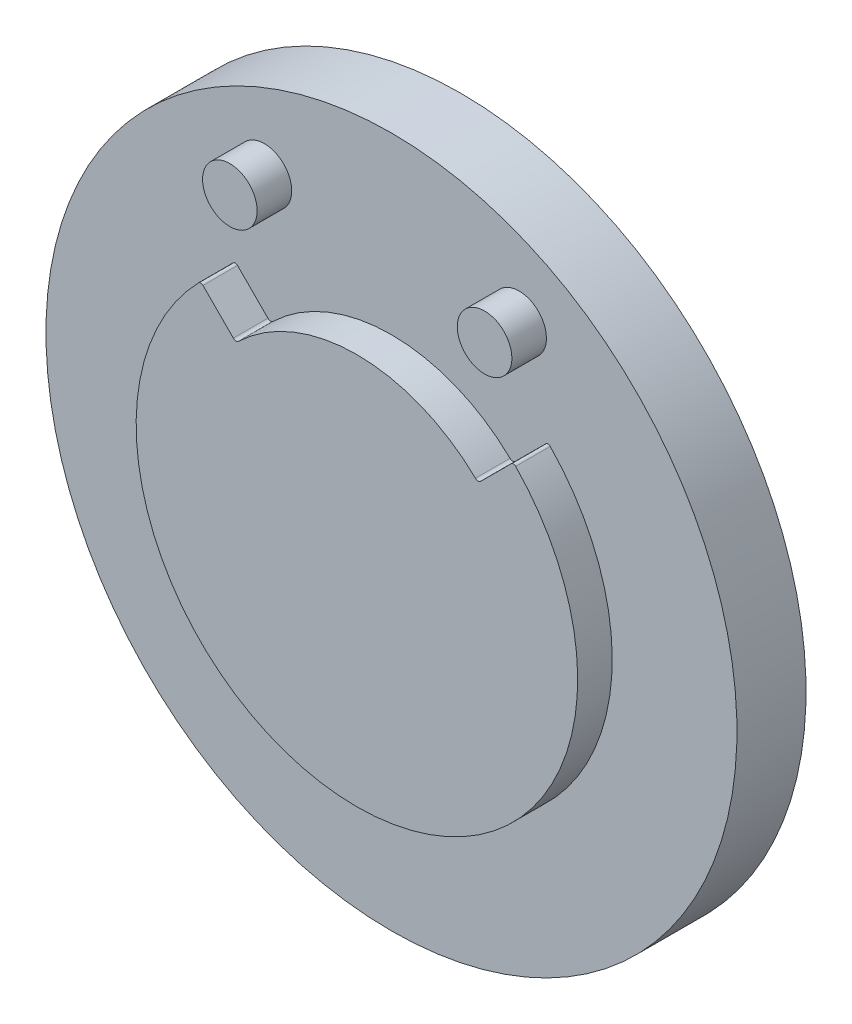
ISO-10303-21;
HEADER;
FILE_DESCRIPTION(('STEP AP214'),'2;1');
FILE_NAME('part.step','',(''),(''),'','','');
FILE_SCHEMA(('AUTOMOTIVE_DESIGN { 1 0 10303 214 1 1 1 1 }'));
ENDSEC;
DATA;
#1=APPLICATION_CONTEXT('core data for automotive mechanical design processes');
#2=APPLICATION_PROTOCOL_DEFINITION('international standard','automotive_design',2000,#1);
#3=PRODUCT_CONTEXT('',#1,'mechanical');
#4=PRODUCT('Part','Part','',(#3));
#5=PRODUCT_RELATED_PRODUCT_CATEGORY('part','',(#4));
#6=PRODUCT_DEFINITION_FORMATION('','',#4);
#7=PRODUCT_DEFINITION_CONTEXT('part definition',#1,'design');
#8=PRODUCT_DEFINITION('design','',#6,#7);
#9=PRODUCT_DEFINITION_SHAPE('','',#8);
#10=(LENGTH_UNIT() NAMED_UNIT(*) SI_UNIT(.MILLI.,.METRE.));
#11=(NAMED_UNIT(*) PLANE_ANGLE_UNIT() SI_UNIT($,.RADIAN.));
#12=(NAMED_UNIT(*) SI_UNIT($,.STERADIAN.) SOLID_ANGLE_UNIT());
#13=UNCERTAINTY_MEASURE_WITH_UNIT(LENGTH_MEASURE(1.E-05),#10,'distance_accuracy_value','');
#14=(GEOMETRIC_REPRESENTATION_CONTEXT(3) GLOBAL_UNCERTAINTY_ASSIGNED_CONTEXT((#13)) GLOBAL_UNIT_ASSIGNED_CONTEXT((#10,
#11,#12)) REPRESENTATION_CONTEXT('',''));
#15=CARTESIAN_POINT('',(0.,0.,0.));
#16=DIRECTION('',(0.,0.,1.));
#17=DIRECTION('',(1.,0.,0.));
#18=AXIS2_PLACEMENT_3D('',#15,#16,#17);
#19=CARTESIAN_POINT('',(6.4640453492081,5.6616797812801,-12.5137145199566));
#20=DIRECTION('',(2.00724619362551E-07,0.000161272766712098,0.999999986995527));
#21=DIRECTION('',(0.,-0.999999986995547,0.000161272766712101));
#22=AXIS2_PLACEMENT_3D('',#19,#20,#21);
#23=PLANE('',#22);
#24=CARTESIAN_POINT('',(6.46404534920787,5.66167978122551,-12.5137148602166));
#25=DIRECTION('',(-2.00724619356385E-07,-0.000161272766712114,-0.999999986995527));
#26=DIRECTION('',(0.,0.999999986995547,-0.000161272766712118));
#27=AXIS2_PLACEMENT_3D('',#24,#25,#26);
#28=CIRCLE('',#27,25.);
#29=CARTESIAN_POINT('',(6.46404534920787,30.6616794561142,-12.5177466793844));
#30=VERTEX_POINT('',#29);
#31=EDGE_CURVE('E40',#30,#30,#28,.T.);
#32=ORIENTED_EDGE('',*,*,#31,.T.);
#33=EDGE_LOOP('',(#32));
#34=FACE_BOUND('',#33,.T.);
#35=ADVANCED_FACE('F36',(#34),#23,.F.);
#36=CARTESIAN_POINT('',(6.46404534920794,5.66167978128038,-12.5137145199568));
#37=DIRECTION('',(-2.00724619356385E-07,-0.000161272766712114,-0.999999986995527));
#38=DIRECTION('',(0.,0.999999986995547,-0.000161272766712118));
#39=AXIS2_PLACEMENT_3D('',#36,#37,#38);
#40=CYLINDRICAL_SURFACE('',#39,25.);
#41=CARTESIAN_POINT('',(6.46403531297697,5.65361614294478,-62.5137138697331));
#42=DIRECTION('',(-2.00724619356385E-07,-0.000161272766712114,-0.999999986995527));
#43=DIRECTION('',(0.,0.999999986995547,-0.000161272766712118));
#44=AXIS2_PLACEMENT_3D('',#41,#42,#43);
#45=CIRCLE('',#44,25.);
#46=CARTESIAN_POINT('',(6.46403531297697,30.6536158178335,-62.5177456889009));
#47=VERTEX_POINT('',#46);
#48=EDGE_CURVE('E154',#47,#47,#45,.T.);
#49=ORIENTED_EDGE('',*,*,#48,.T.);
#50=EDGE_LOOP('',(#49));
#51=FACE_BOUND('',#50,.T.);
#52=ORIENTED_EDGE('',*,*,#31,.F.);
#53=EDGE_LOOP('',(#52));
#54=FACE_BOUND('',#53,.T.);
#55=ADVANCED_FACE('F228',(#51,#54),#40,.F.);
#56=CARTESIAN_POINT('',(6.46404534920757,5.66167978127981,-12.5137145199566));
#57=DIRECTION('',(2.00724619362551E-07,0.000161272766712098,0.999999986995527));
#58=DIRECTION('',(0.,-0.999999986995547,0.000161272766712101));
#59=AXIS2_PLACEMENT_3D('',#56,#57,#58);
#60=PLANE('',#59);
#61=CARTESIAN_POINT('',(6.46404534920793,5.66167978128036,-12.5137145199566));
#62=DIRECTION('',(-2.00724619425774E-07,-0.000161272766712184,-0.999999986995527));
#63=DIRECTION('',(0.,0.999999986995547,-0.000161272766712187));
#64=AXIS2_PLACEMENT_3D('',#61,#62,#63);
#65=CIRCLE('',#64,250.);
#66=CARTESIAN_POINT('',(6.46404534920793,255.661676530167,-12.5540327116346));
#67=VERTEX_POINT('',#66);
#68=EDGE_CURVE('E45',#67,#67,#65,.T.);
#69=ORIENTED_EDGE('',*,*,#68,.F.);
#70=EDGE_LOOP('',(#69));
#71=FACE_BOUND('',#70,.T.);
#72=CARTESIAN_POINT('',(6.46404534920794,5.66167978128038,-12.5137145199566));
#73=DIRECTION('',(2.00724619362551E-07,0.000161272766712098,0.999999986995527));
#74=DIRECTION('',(0.,-0.999999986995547,0.000161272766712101));
#75=AXIS2_PLACEMENT_3D('',#72,#73,#74);
#76=CIRCLE('',#75,159.746);
#77=CARTESIAN_POINT('',(121.322713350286,116.685418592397,-12.531642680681));
#78=VERTEX_POINT('',#77);
#79=CARTESIAN_POINT('',(-108.1495970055,116.938349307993,-12.531637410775));
#80=VERTEX_POINT('',#79);
#81=EDGE_CURVE('E58',#78,#80,#76,.F.);
#82=ORIENTED_EDGE('',*,*,#81,.T.);
#83=CARTESIAN_POINT('',(-106.538149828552,115.373819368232,-12.5313854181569));
#84=DIRECTION('',(2.00724619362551E-07,0.000161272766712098,0.999999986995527));
#85=DIRECTION('',(0.,-0.999999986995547,0.000161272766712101));
#86=AXIS2_PLACEMENT_3D('',#83,#84,#85);
#87=CIRCLE('',#86,2.24599999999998);
#88=CARTESIAN_POINT('',(-104.948238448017,116.96022969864,-12.5316415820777));
#89=VERTEX_POINT('',#88);
#90=EDGE_CURVE('E151',#80,#89,#87,.F.);
#91=ORIENTED_EDGE('',*,*,#90,.T.);
#92=DIRECTION('',(0.706326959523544,-0.707885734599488,0.000114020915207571));
#93=VECTOR('',#92,1.);
#94=CARTESIAN_POINT('',(-82.9532947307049,94.9167458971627,-12.5280909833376));
#95=LINE('',#94,#93);
#96=CARTESIAN_POINT('',(-82.9532947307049,94.9167458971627,-12.5280909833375));
#97=VERTEX_POINT('',#96);
#98=EDGE_CURVE('E179',#89,#97,#95,.T.);
#99=ORIENTED_EDGE('',*,*,#98,.T.);
#100=CARTESIAN_POINT('',(-81.0037773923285,96.8619703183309,-12.528405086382));
#101=DIRECTION('',(2.00724619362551E-07,0.000161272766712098,0.999999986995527));
#102=DIRECTION('',(0.,-0.999999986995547,0.000161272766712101));
#103=AXIS2_PLACEMENT_3D('',#100,#101,#102);
#104=CIRCLE('',#103,2.754);
#105=CARTESIAN_POINT('',(-79.0975028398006,94.8743503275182,-12.528084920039));
#106=VERTEX_POINT('',#105);
#107=EDGE_CURVE('E176',#97,#106,#104,.T.);
#108=ORIENTED_EDGE('',*,*,#107,.T.);
#109=CARTESIAN_POINT('',(6.46404534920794,5.66167978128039,-12.5137145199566));
#110=DIRECTION('',(2.00724619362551E-07,0.000161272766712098,0.999999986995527));
#111=DIRECTION('',(0.,-0.999999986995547,0.000161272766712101));
#112=AXIS2_PLACEMENT_3D('',#109,#110,#111);
#113=CIRCLE('',#112,123.611);
#114=CARTESIAN_POINT('',(92.2220507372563,94.6855171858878,-12.528088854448));
#115=VERTEX_POINT('',#114);
#116=EDGE_CURVE('E173',#106,#115,#113,.F.);
#117=ORIENTED_EDGE('',*,*,#116,.T.);
#118=CARTESIAN_POINT('',(94.1327022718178,96.668930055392,-12.528409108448));
#119=DIRECTION('',(2.00724619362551E-07,0.000161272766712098,0.999999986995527));
#120=DIRECTION('',(0.,-0.999999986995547,0.000161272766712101));
#121=AXIS2_PLACEMENT_3D('',#118,#119,#120);
#122=CIRCLE('',#121,2.75399999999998);
#123=CARTESIAN_POINT('',(96.0779267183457,94.7194127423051,-12.5280950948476));
#124=VERTEX_POINT('',#123);
#125=EDGE_CURVE('E166',#115,#124,#122,.T.);
#126=ORIENTED_EDGE('',*,*,#125,.T.);
#127=DIRECTION('',(0.707885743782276,0.706326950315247,-0.000114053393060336));
#128=VECTOR('',#127,1.);
#129=CARTESIAN_POINT('',(118.121410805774,116.714356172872,-12.5316467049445));
#130=LINE('',#129,#128);
#131=CARTESIAN_POINT('',(118.121410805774,116.714356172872,-12.5316467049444));
#132=VERTEX_POINT('',#131);
#133=EDGE_CURVE('E162',#124,#132,#130,.T.);
#134=ORIENTED_EDGE('',*,*,#133,.T.);
#135=CARTESIAN_POINT('',(119.707821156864,115.124444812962,-12.5313906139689));
#136=DIRECTION('',(2.00724619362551E-07,0.000161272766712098,0.999999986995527));
#137=DIRECTION('',(0.,-0.999999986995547,0.000161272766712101));
#138=AXIS2_PLACEMENT_3D('',#135,#136,#137);
#139=CIRCLE('',#138,2.24599999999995);
#140=EDGE_CURVE('E159',#132,#78,#139,.F.);
#141=ORIENTED_EDGE('',*,*,#140,.T.);
#142=EDGE_LOOP('',(#82,#91,#99,#108,#117,#126,#134,#141));
#143=FACE_BOUND('',#142,.T.);
#144=CARTESIAN_POINT('',(-85.5030432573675,183.262506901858,-12.54233823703));
#145=DIRECTION('',(2.00724619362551E-07,0.000161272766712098,0.999999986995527));
#146=DIRECTION('',(0.,-0.999999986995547,0.000161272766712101));
#147=AXIS2_PLACEMENT_3D('',#144,#145,#146);
#148=CIRCLE('',#147,19.7460000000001);
#149=CARTESIAN_POINT('',(-85.5030432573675,163.516507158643,-12.5391537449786));
#150=VERTEX_POINT('',#149);
#151=EDGE_CURVE('E123',#150,#150,#148,.F.);
#152=ORIENTED_EDGE('',*,*,#151,.T.);
#153=EDGE_LOOP('',(#152));
#154=FACE_BOUND('',#153,.T.);
#155=CARTESIAN_POINT('',(98.8224116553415,183.059344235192,-12.5423424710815));
#156=DIRECTION('',(2.00724619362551E-07,0.000161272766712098,0.999999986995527));
#157=DIRECTION('',(0.,-0.999999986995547,0.000161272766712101));
#158=AXIS2_PLACEMENT_3D('',#155,#156,#157);
#159=CIRCLE('',#158,19.7460000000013);
#160=CARTESIAN_POINT('',(98.8224116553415,163.313344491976,-12.53915797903));
#161=VERTEX_POINT('',#160);
#162=EDGE_CURVE('E380',#161,#161,#159,.F.);
#163=ORIENTED_EDGE('',*,*,#162,.T.);
#164=EDGE_LOOP('',(#163));
#165=FACE_BOUND('',#164,.T.);
#166=ADVANCED_FACE('F182',(#71,#143,#154,#165),#60,.T.);
#167=CARTESIAN_POINT('',(121.422896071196,-216.347417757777,-62.4779342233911));
#168=DIRECTION('',(2.00724619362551E-07,0.000161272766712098,0.999999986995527));
#169=DIRECTION('',(0.,-0.999999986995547,0.000161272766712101));
#170=AXIS2_PLACEMENT_3D('',#167,#168,#169);
#171=PLANE('',#170);
#172=CARTESIAN_POINT('',(6.46403531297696,5.65361614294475,-62.5137138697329));
#173=DIRECTION('',(-2.00724619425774E-07,-0.000161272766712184,-0.999999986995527));
#174=DIRECTION('',(0.,0.999999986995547,-0.000161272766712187));
#175=AXIS2_PLACEMENT_3D('',#172,#173,#174);
#176=CIRCLE('',#175,250.);
#177=CARTESIAN_POINT('',(6.46403531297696,255.653612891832,-62.554032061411));
#178=VERTEX_POINT('',#177);
#179=EDGE_CURVE('E11',#178,#178,#176,.F.);
#180=ORIENTED_EDGE('',*,*,#179,.F.);
#181=EDGE_LOOP('',(#180));
#182=FACE_BOUND('',#181,.T.);
#183=ORIENTED_EDGE('',*,*,#48,.F.);
#184=EDGE_LOOP('',(#183));
#185=FACE_BOUND('',#184,.T.);
#186=ADVANCED_FACE('F214',(#182,#185),#171,.F.);
#187=CARTESIAN_POINT('',(6.46404534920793,5.66167978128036,-12.5137145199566));
#188=DIRECTION('',(-2.00724619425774E-07,-0.000161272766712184,-0.999999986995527));
#189=DIRECTION('',(0.,0.999999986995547,-0.000161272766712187));
#190=AXIS2_PLACEMENT_3D('',#187,#188,#189);
#191=CYLINDRICAL_SURFACE('',#190,250.);
#192=ORIENTED_EDGE('',*,*,#68,.T.);
#193=EDGE_LOOP('',(#192));
#194=FACE_BOUND('',#193,.T.);
#195=ORIENTED_EDGE('',*,*,#179,.T.);
#196=EDGE_LOOP('',(#195));
#197=FACE_BOUND('',#196,.T.);
#198=ADVANCED_FACE('F38',(#194,#197),#191,.T.);
#199=CARTESIAN_POINT('',(6.46395161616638,5.58636970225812,-479.487026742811));
#200=DIRECTION('',(2.00724619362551E-07,0.000161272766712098,0.999999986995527));
#201=DIRECTION('',(0.,-0.999999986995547,0.000161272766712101));
#202=AXIS2_PLACEMENT_3D('',#199,#200,#201);
#203=CYLINDRICAL_SURFACE('',#202,159.746);
#204=DIRECTION('',(2.00724619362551E-07,0.000161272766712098,0.999999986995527));
#205=VECTOR('',#204,1.);
#206=CARTESIAN_POINT('',(121.322619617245,116.610108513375,-479.504954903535));
#207=LINE('',#206,#205);
#208=CARTESIAN_POINT('',(121.322718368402,116.689450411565,12.4683569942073));
#209=VERTEX_POINT('',#208);
#210=EDGE_CURVE('E101',#78,#209,#207,.T.);
#211=ORIENTED_EDGE('',*,*,#210,.T.);
#212=CARTESIAN_POINT('',(6.46405036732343,5.66571160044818,12.4862851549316));
#213=DIRECTION('',(2.00724619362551E-07,0.000161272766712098,0.999999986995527));
#214=DIRECTION('',(0.,-0.999999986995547,0.000161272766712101));
#215=AXIS2_PLACEMENT_3D('',#212,#213,#214);
#216=CIRCLE('',#215,159.746);
#217=CARTESIAN_POINT('',(-108.149591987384,116.94238112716,12.4683622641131));
#218=VERTEX_POINT('',#217);
#219=EDGE_CURVE('E53',#218,#209,#216,.T.);
#220=ORIENTED_EDGE('',*,*,#219,.F.);
#221=DIRECTION('',(2.00724619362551E-07,0.000161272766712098,0.999999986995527));
#222=VECTOR('',#221,1.);
#223=CARTESIAN_POINT('',(-108.149690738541,116.86303922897,-479.504949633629));
#224=LINE('',#223,#222);
#225=EDGE_CURVE('E106',#80,#218,#224,.T.);
#226=ORIENTED_EDGE('',*,*,#225,.F.);
#227=ORIENTED_EDGE('',*,*,#81,.F.);
#228=EDGE_LOOP('',(#211,#220,#226,#227));
#229=FACE_BOUND('',#228,.T.);
#230=ADVANCED_FACE('F103',(#229),#203,.T.);
#231=CARTESIAN_POINT('',(119.707727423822,115.049134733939,-479.504702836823));
#232=DIRECTION('',(2.00724619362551E-07,0.000161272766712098,0.999999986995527));
#233=DIRECTION('',(0.,-0.999999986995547,0.000161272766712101));
#234=AXIS2_PLACEMENT_3D('',#231,#232,#233);
#235=CYLINDRICAL_SURFACE('',#234,2.24599999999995);
#236=DIRECTION('',(2.00724619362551E-07,0.000161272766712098,0.999999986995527));
#237=VECTOR('',#236,1.);
#238=CARTESIAN_POINT('',(118.121317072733,116.63904609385,-479.504958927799));
#239=LINE('',#238,#237);
#240=CARTESIAN_POINT('',(118.12141582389,116.71838799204,12.4683529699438));
#241=VERTEX_POINT('',#240);
#242=EDGE_CURVE('E105',#132,#241,#239,.T.);
#243=ORIENTED_EDGE('',*,*,#242,.T.);
#244=CARTESIAN_POINT('',(119.707826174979,115.128476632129,12.4686090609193));
#245=DIRECTION('',(2.00724619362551E-07,0.000161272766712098,0.999999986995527));
#246=DIRECTION('',(0.,-0.999999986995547,0.000161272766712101));
#247=AXIS2_PLACEMENT_3D('',#244,#245,#246);
#248=CIRCLE('',#247,2.24599999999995);
#249=EDGE_CURVE('E109',#209,#241,#248,.T.);
#250=ORIENTED_EDGE('',*,*,#249,.F.);
#251=ORIENTED_EDGE('',*,*,#210,.F.);
#252=ORIENTED_EDGE('',*,*,#140,.F.);
#253=EDGE_LOOP('',(#243,#250,#251,#252));
#254=FACE_BOUND('',#253,.T.);
#255=ADVANCED_FACE('F110',(#254),#235,.T.);
#256=CARTESIAN_POINT('',(118.121317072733,116.63904609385,-479.504958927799));
#257=DIRECTION('',(-0.706326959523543,0.707885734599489,-0.000114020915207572));
#258=DIRECTION('',(-0.707885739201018,-0.70632696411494,0.));
#259=AXIS2_PLACEMENT_3D('',#256,#257,#258);
#260=PLANE('',#259);
#261=DIRECTION('',(2.00724619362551E-07,0.000161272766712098,0.999999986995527));
#262=VECTOR('',#261,1.);
#263=CARTESIAN_POINT('',(96.0778329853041,94.6441026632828,-479.501407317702));
#264=LINE('',#263,#262);
#265=CARTESIAN_POINT('',(96.0779317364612,94.7234445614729,12.4719045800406));
#266=VERTEX_POINT('',#265);
#267=EDGE_CURVE('E147',#124,#266,#264,.T.);
#268=ORIENTED_EDGE('',*,*,#267,.T.);
#269=DIRECTION('',(-0.707885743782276,-0.706326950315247,0.000114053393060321));
#270=VECTOR('',#269,1.);
#271=CARTESIAN_POINT('',(118.12141582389,116.71838799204,12.4683529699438));
#272=LINE('',#271,#270);
#273=EDGE_CURVE('E115',#241,#266,#272,.T.);
#274=ORIENTED_EDGE('',*,*,#273,.F.);
#275=ORIENTED_EDGE('',*,*,#242,.F.);
#276=ORIENTED_EDGE('',*,*,#133,.F.);
#277=EDGE_LOOP('',(#268,#274,#275,#276));
#278=FACE_BOUND('',#277,.T.);
#279=ADVANCED_FACE('F204',(#278),#260,.T.);
#280=CARTESIAN_POINT('',(94.1326085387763,96.5936199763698,-479.501721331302));
#281=DIRECTION('',(2.00724619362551E-07,0.000161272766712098,0.999999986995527));
#282=DIRECTION('',(0.,-0.999999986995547,0.000161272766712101));
#283=AXIS2_PLACEMENT_3D('',#280,#281,#282);
#284=CYLINDRICAL_SURFACE('',#283,2.75399999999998);
#285=DIRECTION('',(2.00724619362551E-07,0.000161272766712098,0.999999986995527));
#286=VECTOR('',#285,1.);
#287=CARTESIAN_POINT('',(92.2219570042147,94.6102071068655,-479.501401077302));
#288=LINE('',#287,#286);
#289=CARTESIAN_POINT('',(92.2220557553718,94.6895490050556,12.4719108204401));
#290=VERTEX_POINT('',#289);
#291=EDGE_CURVE('E145',#115,#290,#288,.T.);
#292=ORIENTED_EDGE('',*,*,#291,.T.);
#293=CARTESIAN_POINT('',(94.1327072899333,96.6729618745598,12.4715905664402));
#294=DIRECTION('',(-2.00724619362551E-07,-0.000161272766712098,-0.999999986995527));
#295=DIRECTION('',(0.,-0.999999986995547,0.000161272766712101));
#296=AXIS2_PLACEMENT_3D('',#293,#294,#295);
#297=CIRCLE('',#296,2.75399999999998);
#298=EDGE_CURVE('E128',#266,#290,#297,.T.);
#299=ORIENTED_EDGE('',*,*,#298,.F.);
#300=ORIENTED_EDGE('',*,*,#267,.F.);
#301=ORIENTED_EDGE('',*,*,#125,.F.);
#302=EDGE_LOOP('',(#292,#299,#300,#301));
#303=FACE_BOUND('',#302,.T.);
#304=ADVANCED_FACE('F201',(#303),#284,.F.);
#305=CARTESIAN_POINT('',(6.46395161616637,5.58636970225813,-479.487026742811));
#306=DIRECTION('',(2.00724619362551E-07,0.000161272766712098,0.999999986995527));
#307=DIRECTION('',(0.,-0.999999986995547,0.000161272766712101));
#308=AXIS2_PLACEMENT_3D('',#305,#306,#307);
#309=CYLINDRICAL_SURFACE('',#308,123.611);
#310=DIRECTION('',(2.00724619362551E-07,0.000161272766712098,0.999999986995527));
#311=VECTOR('',#310,1.);
#312=CARTESIAN_POINT('',(-79.0975965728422,94.799040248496,-479.501397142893));
#313=LINE('',#312,#311);
#314=CARTESIAN_POINT('',(-79.0974978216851,94.8783821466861,12.4719147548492));
#315=VERTEX_POINT('',#314);
#316=EDGE_CURVE('E143',#106,#315,#313,.T.);
#317=ORIENTED_EDGE('',*,*,#316,.T.);
#318=CARTESIAN_POINT('',(6.46405036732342,5.66571160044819,12.4862851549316));
#319=DIRECTION('',(2.00724619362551E-07,0.000161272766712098,0.999999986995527));
#320=DIRECTION('',(0.,-0.999999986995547,0.000161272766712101));
#321=AXIS2_PLACEMENT_3D('',#318,#319,#320);
#322=CIRCLE('',#321,123.611);
#323=EDGE_CURVE('E131',#290,#315,#322,.T.);
#324=ORIENTED_EDGE('',*,*,#323,.F.);
#325=ORIENTED_EDGE('',*,*,#291,.F.);
#326=ORIENTED_EDGE('',*,*,#116,.F.);
#327=EDGE_LOOP('',(#317,#324,#325,#326));
#328=FACE_BOUND('',#327,.T.);
#329=ADVANCED_FACE('F197',(#328),#309,.T.);
#330=CARTESIAN_POINT('',(-81.0038711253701,96.7866602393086,-479.501717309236));
#331=DIRECTION('',(2.00724619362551E-07,0.000161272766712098,0.999999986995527));
#332=DIRECTION('',(0.,-0.999999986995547,0.000161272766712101));
#333=AXIS2_PLACEMENT_3D('',#330,#331,#332);
#334=CYLINDRICAL_SURFACE('',#333,2.754);
#335=DIRECTION('',(2.00724619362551E-07,0.000161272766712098,0.999999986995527));
#336=VECTOR('',#335,1.);
#337=CARTESIAN_POINT('',(-82.9533884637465,94.8414358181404,-479.501403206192));
#338=LINE('',#337,#336);
#339=CARTESIAN_POINT('',(-82.9532897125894,94.9207777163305,12.4719086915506));
#340=VERTEX_POINT('',#339);
#341=EDGE_CURVE('E141',#97,#340,#338,.T.);
#342=ORIENTED_EDGE('',*,*,#341,.T.);
#343=CARTESIAN_POINT('',(-81.003772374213,96.8660021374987,12.4715945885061));
#344=DIRECTION('',(-2.00724619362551E-07,-0.000161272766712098,-0.999999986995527));
#345=DIRECTION('',(0.,-0.999999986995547,0.000161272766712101));
#346=AXIS2_PLACEMENT_3D('',#343,#344,#345);
#347=CIRCLE('',#346,2.754);
#348=EDGE_CURVE('E134',#315,#340,#347,.T.);
#349=ORIENTED_EDGE('',*,*,#348,.F.);
#350=ORIENTED_EDGE('',*,*,#316,.F.);
#351=ORIENTED_EDGE('',*,*,#107,.F.);
#352=EDGE_LOOP('',(#342,#349,#350,#351));
#353=FACE_BOUND('',#352,.T.);
#354=ADVANCED_FACE('F193',(#353),#334,.F.);
#355=CARTESIAN_POINT('',(-82.9533884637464,94.8414358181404,-479.501403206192));
#356=DIRECTION('',(0.707885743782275,0.706326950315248,-0.000114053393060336));
#357=DIRECTION('',(-0.706326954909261,0.707885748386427,0.));
#358=AXIS2_PLACEMENT_3D('',#355,#356,#357);
#359=PLANE('',#358);
#360=DIRECTION('',(2.00724619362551E-07,0.000161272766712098,0.999999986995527));
#361=VECTOR('',#360,1.);
#362=CARTESIAN_POINT('',(-104.948332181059,116.884919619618,-479.504953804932));
#363=LINE('',#362,#361);
#364=CARTESIAN_POINT('',(-104.948233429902,116.964261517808,12.4683580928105));
#365=VERTEX_POINT('',#364);
#366=EDGE_CURVE('E139',#89,#365,#363,.T.);
#367=ORIENTED_EDGE('',*,*,#366,.T.);
#368=DIRECTION('',(-0.706326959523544,0.707885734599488,-0.000114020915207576));
#369=VECTOR('',#368,1.);
#370=CARTESIAN_POINT('',(-82.9532897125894,94.9207777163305,12.4719086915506));
#371=LINE('',#370,#369);
#372=EDGE_CURVE('E137',#340,#365,#371,.T.);
#373=ORIENTED_EDGE('',*,*,#372,.F.);
#374=ORIENTED_EDGE('',*,*,#341,.F.);
#375=ORIENTED_EDGE('',*,*,#98,.F.);
#376=EDGE_LOOP('',(#367,#373,#374,#375));
#377=FACE_BOUND('',#376,.T.);
#378=ADVANCED_FACE('F189',(#377),#359,.T.);
#379=CARTESIAN_POINT('',(-106.538243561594,115.29850928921,-479.504697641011));
#380=DIRECTION('',(2.00724619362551E-07,0.000161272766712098,0.999999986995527));
#381=DIRECTION('',(0.,-0.999999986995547,0.000161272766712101));
#382=AXIS2_PLACEMENT_3D('',#379,#380,#381);
#383=CYLINDRICAL_SURFACE('',#382,2.24599999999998);
#384=ORIENTED_EDGE('',*,*,#225,.T.);
#385=CARTESIAN_POINT('',(-106.538144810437,115.3778511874,12.4686142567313));
#386=DIRECTION('',(2.00724619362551E-07,0.000161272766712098,0.999999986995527));
#387=DIRECTION('',(0.,-0.999999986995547,0.000161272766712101));
#388=AXIS2_PLACEMENT_3D('',#385,#386,#387);
#389=CIRCLE('',#388,2.24599999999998);
#390=EDGE_CURVE('E121',#365,#218,#389,.T.);
#391=ORIENTED_EDGE('',*,*,#390,.F.);
#392=ORIENTED_EDGE('',*,*,#366,.F.);
#393=ORIENTED_EDGE('',*,*,#90,.F.);
#394=EDGE_LOOP('',(#384,#391,#392,#393));
#395=FACE_BOUND('',#394,.T.);
#396=ADVANCED_FACE('F186',(#395),#383,.T.);
#397=CARTESIAN_POINT('',(80.0377212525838,-136.414950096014,12.5091841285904));
#398=DIRECTION('',(2.00724619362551E-07,0.000161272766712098,0.999999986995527));
#399=DIRECTION('',(0.,-0.999999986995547,0.000161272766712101));
#400=AXIS2_PLACEMENT_3D('',#397,#398,#399);
#401=PLANE('',#400);
#402=ORIENTED_EDGE('',*,*,#390,.T.);
#403=ORIENTED_EDGE('',*,*,#219,.T.);
#404=ORIENTED_EDGE('',*,*,#249,.T.);
#405=ORIENTED_EDGE('',*,*,#273,.T.);
#406=ORIENTED_EDGE('',*,*,#298,.T.);
#407=ORIENTED_EDGE('',*,*,#323,.T.);
#408=ORIENTED_EDGE('',*,*,#348,.T.);
#409=ORIENTED_EDGE('',*,*,#372,.T.);
#410=EDGE_LOOP('',(#402,#403,#404,#405,#406,#407,#408,#409));
#411=FACE_BOUND('',#410,.T.);
#412=ADVANCED_FACE('F118',(#411),#401,.T.);
#413=CARTESIAN_POINT('',(-85.5030560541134,183.2522253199,-76.2950847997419));
#414=DIRECTION('',(2.00724619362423E-07,0.000161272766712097,0.999999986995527));
#415=DIRECTION('',(0.,-0.999999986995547,0.0001612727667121));
#416=AXIS2_PLACEMENT_3D('',#413,#414,#415);
#417=CYLINDRICAL_SURFACE('',#416,19.7460000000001);
#418=ORIENTED_EDGE('',*,*,#151,.F.);
#419=EDGE_LOOP('',(#418));
#420=FACE_BOUND('',#419,.T.);
#421=CARTESIAN_POINT('',(-85.503038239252,183.266538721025,12.4576614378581));
#422=DIRECTION('',(2.00724619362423E-07,0.000161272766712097,0.999999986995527));
#423=DIRECTION('',(0.,-0.999999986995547,0.0001612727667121));
#424=AXIS2_PLACEMENT_3D('',#421,#422,#423);
#425=CIRCLE('',#424,19.7460000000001);
#426=CARTESIAN_POINT('',(-85.503038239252,163.520538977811,12.4608459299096));
#427=VERTEX_POINT('',#426);
#428=EDGE_CURVE('E385',#427,#427,#425,.T.);
#429=ORIENTED_EDGE('',*,*,#428,.F.);
#430=EDGE_LOOP('',(#429));
#431=FACE_BOUND('',#430,.T.);
#432=ADVANCED_FACE('F239',(#420,#431),#417,.T.);
#433=CARTESIAN_POINT('',(-76.3063293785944,165.506456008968,12.4605238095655));
#434=DIRECTION('',(2.00724619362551E-07,0.000161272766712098,0.999999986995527));
#435=DIRECTION('',(0.,-0.999999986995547,0.000161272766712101));
#436=AXIS2_PLACEMENT_3D('',#433,#434,#435);
#437=PLANE('',#436);
#438=ORIENTED_EDGE('',*,*,#428,.T.);
#439=EDGE_LOOP('',(#438));
#440=FACE_BOUND('',#439,.T.);
#441=ADVANCED_FACE('F240',(#440),#437,.T.);
#442=CARTESIAN_POINT('',(98.8223988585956,183.049062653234,-76.2950890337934));
#443=DIRECTION('',(2.00724619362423E-07,0.000161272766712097,0.999999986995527));
#444=DIRECTION('',(0.,-0.999999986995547,0.0001612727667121));
#445=AXIS2_PLACEMENT_3D('',#442,#443,#444);
#446=CYLINDRICAL_SURFACE('',#445,19.7460000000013);
#447=ORIENTED_EDGE('',*,*,#162,.F.);
#448=EDGE_LOOP('',(#447));
#449=FACE_BOUND('',#448,.T.);
#450=CARTESIAN_POINT('',(98.822416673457,183.063376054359,12.4576572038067));
#451=DIRECTION('',(2.00724619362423E-07,0.000161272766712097,0.999999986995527));
#452=DIRECTION('',(0.,-0.999999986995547,0.0001612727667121));
#453=AXIS2_PLACEMENT_3D('',#450,#451,#452);
#454=CIRCLE('',#453,19.7460000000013);
#455=CARTESIAN_POINT('',(98.822416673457,163.317376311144,12.4608416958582));
#456=VERTEX_POINT('',#455);
#457=EDGE_CURVE('E383',#456,#456,#454,.T.);
#458=ORIENTED_EDGE('',*,*,#457,.F.);
#459=EDGE_LOOP('',(#458));
#460=FACE_BOUND('',#459,.T.);
#461=ADVANCED_FACE('F243',(#449,#460),#446,.T.);
#462=CARTESIAN_POINT('',(108.019125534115,165.303293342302,12.460519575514));
#463=DIRECTION('',(2.00724619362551E-07,0.000161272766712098,0.999999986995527));
#464=DIRECTION('',(0.,-0.999999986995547,0.000161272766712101));
#465=AXIS2_PLACEMENT_3D('',#462,#463,#464);
#466=PLANE('',#465);
#467=ORIENTED_EDGE('',*,*,#457,.T.);
#468=EDGE_LOOP('',(#467));
#469=FACE_BOUND('',#468,.T.);
#470=ADVANCED_FACE('F245',(#469),#466,.T.);
#471=CLOSED_SHELL('',(#35,#55,#166,#186,#198,#230,#255,#279,#304,#329,#354,#378,#396,#412,#432,
#441,#461,#470));
#472=MANIFOLD_SOLID_BREP('B2',#471);
#473=ADVANCED_BREP_SHAPE_REPRESENTATION('',(#18,#472),#14);
#474=SHAPE_DEFINITION_REPRESENTATION(#9,#473);
ENDSEC;
END-ISO-10303-21;
